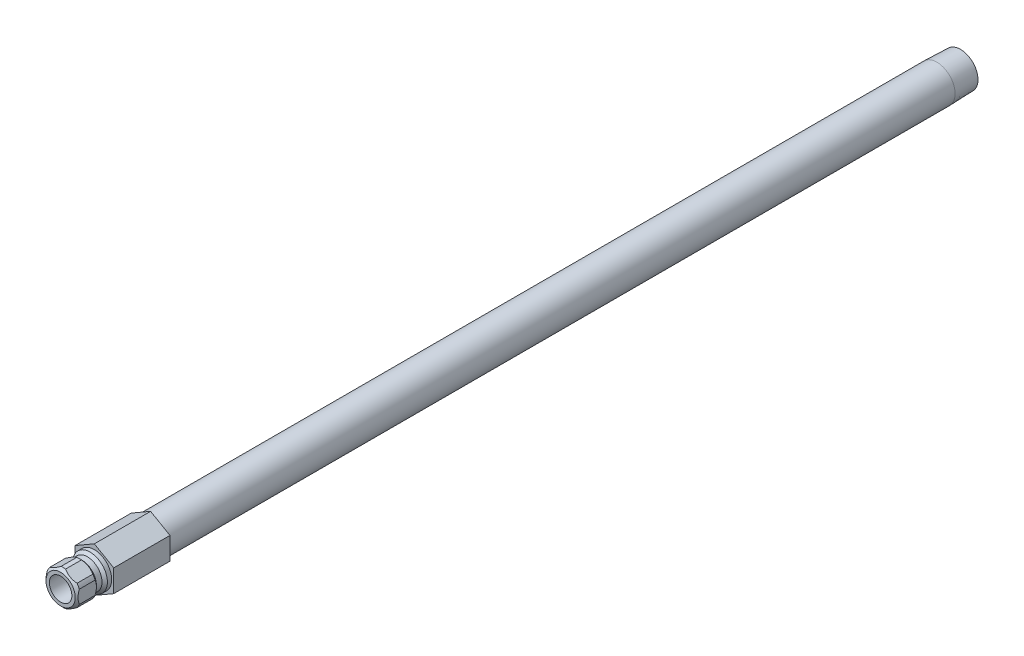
ISO-10303-21;
HEADER;
FILE_DESCRIPTION(('STEP AP214'),'2;1');
FILE_NAME('part.step','',(''),(''),'','','');
FILE_SCHEMA(('AUTOMOTIVE_DESIGN { 1 0 10303 214 1 1 1 1 }'));
ENDSEC;
DATA;
#1=APPLICATION_CONTEXT('core data for automotive mechanical design processes');
#2=APPLICATION_PROTOCOL_DEFINITION('international standard','automotive_design',2000,#1);
#3=PRODUCT_CONTEXT('',#1,'mechanical');
#4=PRODUCT('Part','Part','',(#3));
#5=PRODUCT_RELATED_PRODUCT_CATEGORY('part','',(#4));
#6=PRODUCT_DEFINITION_FORMATION('','',#4);
#7=PRODUCT_DEFINITION_CONTEXT('part definition',#1,'design');
#8=PRODUCT_DEFINITION('design','',#6,#7);
#9=PRODUCT_DEFINITION_SHAPE('','',#8);
#10=(LENGTH_UNIT() NAMED_UNIT(*) SI_UNIT(.MILLI.,.METRE.));
#11=(NAMED_UNIT(*) PLANE_ANGLE_UNIT() SI_UNIT($,.RADIAN.));
#12=(NAMED_UNIT(*) SI_UNIT($,.STERADIAN.) SOLID_ANGLE_UNIT());
#13=UNCERTAINTY_MEASURE_WITH_UNIT(LENGTH_MEASURE(1.E-05),#10,'distance_accuracy_value','');
#14=(GEOMETRIC_REPRESENTATION_CONTEXT(3) GLOBAL_UNCERTAINTY_ASSIGNED_CONTEXT((#13)) GLOBAL_UNIT_ASSIGNED_CONTEXT((#10,
#11,#12)) REPRESENTATION_CONTEXT('',''));
#15=CARTESIAN_POINT('',(0.,0.,0.));
#16=DIRECTION('',(0.,0.,1.));
#17=DIRECTION('',(1.,0.,0.));
#18=AXIS2_PLACEMENT_3D('',#15,#16,#17);
#19=CARTESIAN_POINT('',(0.,0.,0.));
#20=DIRECTION('',(0.,0.,-1.));
#21=DIRECTION('',(0.,1.,0.));
#22=AXIS2_PLACEMENT_3D('',#19,#20,#21);
#23=CYLINDRICAL_SURFACE('',#22,4.8895);
#24=DIRECTION('',(0.,0.,-1.));
#25=VECTOR('',#24,1.);
#26=CARTESIAN_POINT('',(-4.5212,-1.86170910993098,0.));
#27=LINE('',#26,#25);
#28=CARTESIAN_POINT('',(-4.5212,-1.86170910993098,4.318));
#29=VERTEX_POINT('',#28);
#30=CARTESIAN_POINT('',(-4.5212,-1.86170910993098,8.763));
#31=VERTEX_POINT('',#30);
#32=EDGE_CURVE('E61',#29,#31,#27,.F.);
#33=ORIENTED_EDGE('',*,*,#32,.F.);
#34=CARTESIAN_POINT('',(0.,0.,4.318));
#35=DIRECTION('',(0.,0.,-1.));
#36=DIRECTION('',(0.,1.,0.));
#37=AXIS2_PLACEMENT_3D('',#34,#35,#36);
#38=CIRCLE('',#37,4.8895);
#39=CARTESIAN_POINT('',(-3.87288738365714,-2.98461950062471,4.318));
#40=VERTEX_POINT('',#39);
#41=EDGE_CURVE('E650',#40,#29,#38,.T.);
#42=ORIENTED_EDGE('',*,*,#41,.F.);
#43=DIRECTION('',(0.,0.,-1.));
#44=VECTOR('',#43,1.);
#45=CARTESIAN_POINT('',(-3.87288738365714,-2.98461950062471,0.));
#46=LINE('',#45,#44);
#47=CARTESIAN_POINT('',(-3.87288738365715,-2.98461950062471,8.763));
#48=VERTEX_POINT('',#47);
#49=EDGE_CURVE('E218',#48,#40,#46,.T.);
#50=ORIENTED_EDGE('',*,*,#49,.F.);
#51=CARTESIAN_POINT('',(0.,0.,8.763));
#52=DIRECTION('',(0.,0.,-1.));
#53=DIRECTION('',(0.,1.,0.));
#54=AXIS2_PLACEMENT_3D('',#51,#52,#53);
#55=CIRCLE('',#54,4.8895);
#56=EDGE_CURVE('E189',#48,#31,#55,.T.);
#57=ORIENTED_EDGE('',*,*,#56,.T.);
#58=EDGE_LOOP('',(#33,#42,#50,#57));
#59=FACE_BOUND('',#58,.T.);
#60=ADVANCED_FACE('F34',(#59),#23,.T.);
#61=DIRECTION('',(0.,0.,-1.));
#62=VECTOR('',#61,1.);
#63=CARTESIAN_POINT('',(-0.648312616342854,-4.84632861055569,0.));
#64=LINE('',#63,#62);
#65=CARTESIAN_POINT('',(-0.648312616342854,-4.84632861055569,4.318));
#66=VERTEX_POINT('',#65);
#67=CARTESIAN_POINT('',(-0.648312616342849,-4.84632861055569,8.763));
#68=VERTEX_POINT('',#67);
#69=EDGE_CURVE('E232',#66,#68,#64,.F.);
#70=ORIENTED_EDGE('',*,*,#69,.F.);
#71=CARTESIAN_POINT('',(0.648312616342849,-4.84632861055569,4.318));
#72=VERTEX_POINT('',#71);
#73=EDGE_CURVE('E388',#72,#66,#38,.T.);
#74=ORIENTED_EDGE('',*,*,#73,.F.);
#75=DIRECTION('',(0.,0.,-1.));
#76=VECTOR('',#75,1.);
#77=CARTESIAN_POINT('',(0.648312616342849,-4.84632861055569,0.));
#78=LINE('',#77,#76);
#79=CARTESIAN_POINT('',(0.648312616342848,-4.84632861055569,8.763));
#80=VERTEX_POINT('',#79);
#81=EDGE_CURVE('E654',#80,#72,#78,.T.);
#82=ORIENTED_EDGE('',*,*,#81,.F.);
#83=EDGE_CURVE('E202',#80,#68,#55,.T.);
#84=ORIENTED_EDGE('',*,*,#83,.T.);
#85=EDGE_LOOP('',(#70,#74,#82,#84));
#86=FACE_BOUND('',#85,.T.);
#87=ADVANCED_FACE('F351',(#86),#23,.T.);
#88=DIRECTION('',(0.,0.,-1.));
#89=VECTOR('',#88,1.);
#90=CARTESIAN_POINT('',(3.87288738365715,-2.98461950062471,0.));
#91=LINE('',#90,#89);
#92=CARTESIAN_POINT('',(3.87288738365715,-2.98461950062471,4.318));
#93=VERTEX_POINT('',#92);
#94=CARTESIAN_POINT('',(3.87288738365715,-2.98461950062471,8.763));
#95=VERTEX_POINT('',#94);
#96=EDGE_CURVE('E294',#93,#95,#91,.F.);
#97=ORIENTED_EDGE('',*,*,#96,.F.);
#98=CARTESIAN_POINT('',(4.5212,-1.86170910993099,4.318));
#99=VERTEX_POINT('',#98);
#100=EDGE_CURVE('E384',#99,#93,#38,.T.);
#101=ORIENTED_EDGE('',*,*,#100,.F.);
#102=DIRECTION('',(0.,0.,-1.));
#103=VECTOR('',#102,1.);
#104=CARTESIAN_POINT('',(4.5212,-1.86170910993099,0.));
#105=LINE('',#104,#103);
#106=CARTESIAN_POINT('',(4.5212,-1.86170910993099,8.763));
#107=VERTEX_POINT('',#106);
#108=EDGE_CURVE('E377',#107,#99,#105,.T.);
#109=ORIENTED_EDGE('',*,*,#108,.F.);
#110=EDGE_CURVE('E195',#107,#95,#55,.T.);
#111=ORIENTED_EDGE('',*,*,#110,.T.);
#112=EDGE_LOOP('',(#97,#101,#109,#111));
#113=FACE_BOUND('',#112,.T.);
#114=ADVANCED_FACE('F355',(#113),#23,.T.);
#115=DIRECTION('',(0.,0.,-1.));
#116=VECTOR('',#115,1.);
#117=CARTESIAN_POINT('',(4.5212,1.86170910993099,0.));
#118=LINE('',#117,#116);
#119=CARTESIAN_POINT('',(4.5212,1.86170910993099,4.318));
#120=VERTEX_POINT('',#119);
#121=CARTESIAN_POINT('',(4.5212,1.86170910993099,8.763));
#122=VERTEX_POINT('',#121);
#123=EDGE_CURVE('E373',#120,#122,#118,.F.);
#124=ORIENTED_EDGE('',*,*,#123,.F.);
#125=CARTESIAN_POINT('',(3.87288738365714,2.98461950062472,4.318));
#126=VERTEX_POINT('',#125);
#127=EDGE_CURVE('E200',#126,#120,#38,.T.);
#128=ORIENTED_EDGE('',*,*,#127,.F.);
#129=DIRECTION('',(0.,0.,-1.));
#130=VECTOR('',#129,1.);
#131=CARTESIAN_POINT('',(3.87288738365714,2.98461950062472,0.));
#132=LINE('',#131,#130);
#133=CARTESIAN_POINT('',(3.87288738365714,2.98461950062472,8.763));
#134=VERTEX_POINT('',#133);
#135=EDGE_CURVE('E651',#134,#126,#132,.T.);
#136=ORIENTED_EDGE('',*,*,#135,.F.);
#137=EDGE_CURVE('E188',#134,#122,#55,.T.);
#138=ORIENTED_EDGE('',*,*,#137,.T.);
#139=EDGE_LOOP('',(#124,#128,#136,#138));
#140=FACE_BOUND('',#139,.T.);
#141=ADVANCED_FACE('F361',(#140),#23,.T.);
#142=DIRECTION('',(0.,0.,-1.));
#143=VECTOR('',#142,1.);
#144=CARTESIAN_POINT('',(0.648312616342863,4.84632861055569,0.));
#145=LINE('',#144,#143);
#146=CARTESIAN_POINT('',(0.648312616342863,4.84632861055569,4.318));
#147=VERTEX_POINT('',#146);
#148=CARTESIAN_POINT('',(0.648312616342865,4.84632861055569,8.763));
#149=VERTEX_POINT('',#148);
#150=EDGE_CURVE('E652',#147,#149,#145,.F.);
#151=ORIENTED_EDGE('',*,*,#150,.F.);
#152=CARTESIAN_POINT('',(-0.648312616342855,4.84632861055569,4.318));
#153=VERTEX_POINT('',#152);
#154=EDGE_CURVE('E179',#153,#147,#38,.T.);
#155=ORIENTED_EDGE('',*,*,#154,.F.);
#156=DIRECTION('',(0.,0.,-1.));
#157=VECTOR('',#156,1.);
#158=CARTESIAN_POINT('',(-0.648312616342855,4.84632861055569,0.));
#159=LINE('',#158,#157);
#160=CARTESIAN_POINT('',(-0.648312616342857,4.84632861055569,8.763));
#161=VERTEX_POINT('',#160);
#162=EDGE_CURVE('E163',#161,#153,#159,.T.);
#163=ORIENTED_EDGE('',*,*,#162,.F.);
#164=EDGE_CURVE('E177',#161,#149,#55,.T.);
#165=ORIENTED_EDGE('',*,*,#164,.T.);
#166=EDGE_LOOP('',(#151,#155,#163,#165));
#167=FACE_BOUND('',#166,.T.);
#168=ADVANCED_FACE('F176',(#167),#23,.T.);
#169=CARTESIAN_POINT('',(0.,4.8895,0.));
#170=DIRECTION('',(0.,0.,1.));
#171=DIRECTION('',(0.,-1.,0.));
#172=AXIS2_PLACEMENT_3D('',#169,#170,#171);
#173=PLANE('',#172);
#174=CARTESIAN_POINT('',(0.,0.,0.));
#175=DIRECTION('',(0.,0.,-1.));
#176=DIRECTION('',(0.,1.,0.));
#177=AXIS2_PLACEMENT_3D('',#174,#175,#176);
#178=CIRCLE('',#177,4.8895);
#179=CARTESIAN_POINT('',(0.,4.8895,0.));
#180=VERTEX_POINT('',#179);
#181=EDGE_CURVE('E395',#180,#180,#178,.T.);
#182=ORIENTED_EDGE('',*,*,#181,.T.);
#183=EDGE_LOOP('',(#182));
#184=FACE_BOUND('',#183,.T.);
#185=DIRECTION('',(-0.866025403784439,-0.5,0.));
#186=VECTOR('',#185,1.);
#187=CARTESIAN_POINT('',(0.,6.3058196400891,0.));
#188=LINE('',#187,#186);
#189=CARTESIAN_POINT('',(0.,6.3058196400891,0.));
#190=VERTEX_POINT('',#189);
#191=CARTESIAN_POINT('',(-5.461,3.15290982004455,0.));
#192=VERTEX_POINT('',#191);
#193=EDGE_CURVE('E445',#190,#192,#188,.T.);
#194=ORIENTED_EDGE('',*,*,#193,.T.);
#195=DIRECTION('',(0.,-1.,0.));
#196=VECTOR('',#195,1.);
#197=CARTESIAN_POINT('',(-5.461,3.15290982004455,0.));
#198=LINE('',#197,#196);
#199=CARTESIAN_POINT('',(-5.461,-3.15290982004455,0.));
#200=VERTEX_POINT('',#199);
#201=EDGE_CURVE('E448',#192,#200,#198,.T.);
#202=ORIENTED_EDGE('',*,*,#201,.T.);
#203=DIRECTION('',(0.866025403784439,-0.5,0.));
#204=VECTOR('',#203,1.);
#205=CARTESIAN_POINT('',(-5.461,-3.15290982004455,0.));
#206=LINE('',#205,#204);
#207=CARTESIAN_POINT('',(0.,-6.30581964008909,0.));
#208=VERTEX_POINT('',#207);
#209=EDGE_CURVE('E451',#200,#208,#206,.T.);
#210=ORIENTED_EDGE('',*,*,#209,.T.);
#211=DIRECTION('',(0.866025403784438,0.5,0.));
#212=VECTOR('',#211,1.);
#213=CARTESIAN_POINT('',(0.,-6.30581964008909,0.));
#214=LINE('',#213,#212);
#215=CARTESIAN_POINT('',(5.461,-3.15290982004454,0.));
#216=VERTEX_POINT('',#215);
#217=EDGE_CURVE('E454',#208,#216,#214,.T.);
#218=ORIENTED_EDGE('',*,*,#217,.T.);
#219=DIRECTION('',(0.,1.,0.));
#220=VECTOR('',#219,1.);
#221=CARTESIAN_POINT('',(5.461,-3.15290982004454,0.));
#222=LINE('',#221,#220);
#223=CARTESIAN_POINT('',(5.461,3.15290982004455,0.));
#224=VERTEX_POINT('',#223);
#225=EDGE_CURVE('E456',#216,#224,#222,.T.);
#226=ORIENTED_EDGE('',*,*,#225,.T.);
#227=DIRECTION('',(-0.866025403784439,0.5,0.));
#228=VECTOR('',#227,1.);
#229=CARTESIAN_POINT('',(5.461,3.15290982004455,0.));
#230=LINE('',#229,#228);
#231=EDGE_CURVE('E424',#224,#190,#230,.T.);
#232=ORIENTED_EDGE('',*,*,#231,.T.);
#233=EDGE_LOOP('',(#194,#202,#210,#218,#226,#232));
#234=FACE_BOUND('',#233,.T.);
#235=ADVANCED_FACE('F360',(#184,#234),#173,.T.);
#236=CARTESIAN_POINT('',(0.,0.,0.));
#237=DIRECTION('',(0.,0.,-1.));
#238=DIRECTION('',(0.,1.,0.));
#239=AXIS2_PLACEMENT_3D('',#236,#237,#238);
#240=CYLINDRICAL_SURFACE('',#239,4.8895);
#241=CARTESIAN_POINT('',(0.,0.,1.2065));
#242=DIRECTION('',(0.,0.,-1.));
#243=DIRECTION('',(0.,1.,0.));
#244=AXIS2_PLACEMENT_3D('',#241,#242,#243);
#245=CIRCLE('',#244,4.8895);
#246=CARTESIAN_POINT('',(0.,4.8895,1.2065));
#247=VERTEX_POINT('',#246);
#248=EDGE_CURVE('E392',#247,#247,#245,.T.);
#249=ORIENTED_EDGE('',*,*,#248,.T.);
#250=EDGE_LOOP('',(#249));
#251=FACE_BOUND('',#250,.T.);
#252=ORIENTED_EDGE('',*,*,#181,.F.);
#253=EDGE_LOOP('',(#252));
#254=FACE_BOUND('',#253,.T.);
#255=ADVANCED_FACE('F366',(#251,#254),#240,.T.);
#256=CARTESIAN_POINT('',(0.,0.,1.2065));
#257=DIRECTION('',(0.,0.,-1.));
#258=DIRECTION('',(0.,1.,0.));
#259=AXIS2_PLACEMENT_3D('',#256,#257,#258);
#260=CONICAL_SURFACE('',#259,4.8895,0.785398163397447);
#261=CARTESIAN_POINT('',(0.,0.,1.9685));
#262=DIRECTION('',(0.,0.,-1.));
#263=DIRECTION('',(0.,1.,0.));
#264=AXIS2_PLACEMENT_3D('',#261,#262,#263);
#265=CIRCLE('',#264,4.1275);
#266=CARTESIAN_POINT('',(0.,4.1275,1.9685));
#267=VERTEX_POINT('',#266);
#268=EDGE_CURVE('E386',#267,#267,#265,.T.);
#269=ORIENTED_EDGE('',*,*,#268,.T.);
#270=EDGE_LOOP('',(#269));
#271=FACE_BOUND('',#270,.T.);
#272=ORIENTED_EDGE('',*,*,#248,.F.);
#273=EDGE_LOOP('',(#272));
#274=FACE_BOUND('',#273,.T.);
#275=ADVANCED_FACE('F704',(#271,#274),#260,.T.);
#276=CARTESIAN_POINT('',(0.,0.,0.));
#277=DIRECTION('',(0.,0.,-1.));
#278=DIRECTION('',(0.,1.,0.));
#279=AXIS2_PLACEMENT_3D('',#276,#277,#278);
#280=CYLINDRICAL_SURFACE('',#279,4.1275);
#281=CARTESIAN_POINT('',(0.,0.,3.556));
#282=DIRECTION('',(0.,0.,-1.));
#283=DIRECTION('',(0.,1.,0.));
#284=AXIS2_PLACEMENT_3D('',#281,#282,#283);
#285=CIRCLE('',#284,4.1275);
#286=CARTESIAN_POINT('',(0.,4.1275,3.556));
#287=VERTEX_POINT('',#286);
#288=EDGE_CURVE('E383',#287,#287,#285,.T.);
#289=ORIENTED_EDGE('',*,*,#288,.T.);
#290=EDGE_LOOP('',(#289));
#291=FACE_BOUND('',#290,.T.);
#292=ORIENTED_EDGE('',*,*,#268,.F.);
#293=EDGE_LOOP('',(#292));
#294=FACE_BOUND('',#293,.T.);
#295=ADVANCED_FACE('F254',(#291,#294),#280,.T.);
#296=CARTESIAN_POINT('',(0.,0.,3.556));
#297=DIRECTION('',(0.,0.,1.));
#298=DIRECTION('',(0.,-1.,0.));
#299=AXIS2_PLACEMENT_3D('',#296,#297,#298);
#300=CONICAL_SURFACE('',#299,4.1275,0.785398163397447);
#301=CARTESIAN_POINT('',(-4.5212,-5.15925306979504,6.2884665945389));
#302=CARTESIAN_POINT('',(-4.5212,-5.03341781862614,6.19384981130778));
#303=CARTESIAN_POINT('',(-4.5212,-4.90687282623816,6.10016148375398));
#304=CARTESIAN_POINT('',(-4.5212,-4.65208542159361,5.91505573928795));
#305=CARTESIAN_POINT('',(-4.5212,-4.52384258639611,5.82363890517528));
#306=CARTESIAN_POINT('',(-4.5212,-4.26444371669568,5.64284060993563));
#307=CARTESIAN_POINT('',(-4.5212,-4.13327280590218,5.55348041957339));
#308=CARTESIAN_POINT('',(-4.5212,-3.86869655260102,5.37814219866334));
#309=CARTESIAN_POINT('',(-4.5212,-3.735291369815,5.29216392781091));
#310=CARTESIAN_POINT('',(-4.5212,-3.45835736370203,5.1196421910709));
#311=CARTESIAN_POINT('',(-4.5212,-3.31467977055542,5.03333631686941));
#312=CARTESIAN_POINT('',(-4.5212,-3.02397608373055,4.86646929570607));
#313=CARTESIAN_POINT('',(-4.5212,-2.87694947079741,4.78590904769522));
#314=CARTESIAN_POINT('',(-4.5212,-2.57957206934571,4.6322757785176));
#315=CARTESIAN_POINT('',(-4.5212,-2.42923274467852,4.55918074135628));
#316=CARTESIAN_POINT('',(-4.5212,-2.12448469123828,4.42211381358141));
#317=CARTESIAN_POINT('',(-4.5212,-1.97007782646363,4.35813782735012));
#318=CARTESIAN_POINT('',(-4.5212,-1.66898205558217,4.24604782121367));
#319=CARTESIAN_POINT('',(-4.5212,-1.52260919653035,4.19709368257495));
#320=CARTESIAN_POINT('',(-4.5212,-1.22638031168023,4.11093488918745));
#321=CARTESIAN_POINT('',(-4.5212,-1.07652404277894,4.07373105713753));
#322=CARTESIAN_POINT('',(-4.5212,-0.776693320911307,4.01362130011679));
#323=CARTESIAN_POINT('',(-4.5212,-0.626768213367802,3.99047322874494));
#324=CARTESIAN_POINT('',(-4.5212,-0.325366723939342,3.95891692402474));
#325=CARTESIAN_POINT('',(-4.5212,-0.173890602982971,3.95050625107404));
#326=CARTESIAN_POINT('',(-4.5212,0.123852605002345,3.94903068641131));
#327=CARTESIAN_POINT('',(-4.5212,0.270117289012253,3.95544130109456));
#328=CARTESIAN_POINT('',(-4.5212,0.561370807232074,3.98210770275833));
#329=CARTESIAN_POINT('',(-4.5212,0.706359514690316,4.0023648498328));
#330=CARTESIAN_POINT('',(-4.5212,0.996462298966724,4.05597163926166));
#331=CARTESIAN_POINT('',(-4.5212,1.14153485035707,4.08954247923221));
#332=CARTESIAN_POINT('',(-4.5212,1.42852462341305,4.16800024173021));
#333=CARTESIAN_POINT('',(-4.5212,1.5704421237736,4.21288616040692));
#334=CARTESIAN_POINT('',(-4.5212,1.86505501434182,4.3171412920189));
#335=CARTESIAN_POINT('',(-4.5212,2.01739126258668,4.37751543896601));
#336=CARTESIAN_POINT('',(-4.5212,2.31809735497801,4.5075182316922));
#337=CARTESIAN_POINT('',(-4.5212,2.46646529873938,4.57715121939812));
#338=CARTESIAN_POINT('',(-4.5212,2.75996557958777,4.72401353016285));
#339=CARTESIAN_POINT('',(-4.5212,2.90508583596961,4.80126680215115));
#340=CARTESIAN_POINT('',(-4.5212,3.19198335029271,4.96166050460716));
#341=CARTESIAN_POINT('',(-4.5212,3.33376113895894,5.04479999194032));
#342=CARTESIAN_POINT('',(-4.5212,3.60742153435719,5.21154136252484));
#343=CARTESIAN_POINT('',(-4.5212,3.73944496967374,5.29491333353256));
#344=CARTESIAN_POINT('',(-4.5212,4.00122581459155,5.4651527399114));
#345=CARTESIAN_POINT('',(-4.5212,4.13098305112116,5.55202044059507));
#346=CARTESIAN_POINT('',(-4.5212,4.387473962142,5.72790624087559));
#347=CARTESIAN_POINT('',(-4.5212,4.51422365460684,5.81690106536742));
#348=CARTESIAN_POINT('',(-4.5212,4.76599253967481,5.99723636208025));
#349=CARTESIAN_POINT('',(-4.5212,4.8910121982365,6.08857618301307));
#350=CARTESIAN_POINT('',(-4.5212,5.01530771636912,6.18087446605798));
#351=B_SPLINE_CURVE_WITH_KNOTS('',3,(#301,#302,#303,#304,#305,#306,#307,#308,#309,#310,#311,
#312,#313,#314,#315,#316,#317,#318,#319,#320,#321,#322,#323,#324,#325,#326,#327,#328,#329,#330,
#331,#332,#333,#334,#335,#336,#337,#338,#339,#340,#341,#342,#343,#344,#345,#346,#347,#348,#349,
#350),.UNSPECIFIED.,.F.,.F.,(4,2,2,2,2,2,2,2,2,2,2,2,2,2,2,2,2,2,2,2,2,2,2,2,4),(0.,
0.472324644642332,0.944769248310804,1.42087610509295,1.89694907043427,2.39966187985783,
2.90245317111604,3.40371602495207,3.90475303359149,4.3673713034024,4.83002195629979,
5.28445770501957,5.73881822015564,6.1773471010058,6.615919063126,7.06210522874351,
7.50825182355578,7.9994594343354,8.49089821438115,8.98393391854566,9.47689080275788,
9.94525924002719,10.4136632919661,10.8782525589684,11.3427141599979),.UNSPECIFIED.);
#352=CARTESIAN_POINT('',(-4.5212,1.86170910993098,4.318));
#353=VERTEX_POINT('',#352);
#354=EDGE_CURVE('E230',#353,#29,#351,.F.);
#355=ORIENTED_EDGE('',*,*,#354,.F.);
#356=CARTESIAN_POINT('',(-3.87288738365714,2.98461950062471,4.318));
#357=VERTEX_POINT('',#356);
#358=EDGE_CURVE('E199',#353,#357,#38,.T.);
#359=ORIENTED_EDGE('',*,*,#358,.T.);
#360=CARTESIAN_POINT('',(-0.647857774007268,4.84659121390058,4.3182));
#361=CARTESIAN_POINT('',(-0.775261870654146,4.77303442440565,4.26213711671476));
#362=CARTESIAN_POINT('',(-0.904457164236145,4.69844348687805,4.21102627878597));
#363=CARTESIAN_POINT('',(-1.16629518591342,4.5472712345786,4.12074318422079));
#364=CARTESIAN_POINT('',(-1.29894624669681,4.47068510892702,4.08160338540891));
#365=CARTESIAN_POINT('',(-1.56203676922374,4.31878972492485,4.01877592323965));
#366=CARTESIAN_POINT('',(-1.69238331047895,4.24353411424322,3.99458163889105));
#367=CARTESIAN_POINT('',(-1.95434729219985,4.09228913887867,3.96102228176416));
#368=CARTESIAN_POINT('',(-2.0859628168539,4.01630088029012,3.95163757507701));
#369=CARTESIAN_POINT('',(-2.35623055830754,3.86026172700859,3.9482192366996));
#370=CARTESIAN_POINT('',(-2.49489129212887,3.78020591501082,3.95501290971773));
#371=CARTESIAN_POINT('',(-2.7710334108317,3.62077518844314,3.98518499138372));
#372=CARTESIAN_POINT('',(-2.90851272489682,3.54140146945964,4.00858815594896));
#373=CARTESIAN_POINT('',(-3.18622016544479,3.38106700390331,4.07155129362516));
#374=CARTESIAN_POINT('',(-3.32634361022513,3.3001666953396,4.11171074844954));
#375=CARTESIAN_POINT('',(-3.60275664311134,3.14057955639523,4.20550294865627));
#376=CARTESIAN_POINT('',(-3.73905611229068,3.06188702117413,4.2590965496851));
#377=CARTESIAN_POINT('',(-3.87334222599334,2.98435689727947,4.31820000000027));
#378=B_SPLINE_CURVE_WITH_KNOTS('',3,(#360,#361,#362,#363,#364,#365,#366,#367,#368,#369,#370,
#371,#372,#373,#374,#375,#376,#377),.UNSPECIFIED.,.F.,.F.,(4,2,2,2,2,2,2,2,4),(0.,
0.472469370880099,0.946208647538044,1.40285320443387,1.85889185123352,2.33874707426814,
2.81931901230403,3.31879975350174,3.81684169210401),.UNSPECIFIED.);
#379=EDGE_CURVE('E260',#153,#357,#378,.T.);
#380=ORIENTED_EDGE('',*,*,#379,.F.);
#381=ORIENTED_EDGE('',*,*,#154,.T.);
#382=CARTESIAN_POINT('',(3.87334222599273,2.98435689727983,4.3182));
#383=CARTESIAN_POINT('',(3.74593812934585,3.05791368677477,4.26213711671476));
#384=CARTESIAN_POINT('',(3.61674283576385,3.13250462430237,4.21102627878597));
#385=CARTESIAN_POINT('',(3.35490481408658,3.28367687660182,4.12074318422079));
#386=CARTESIAN_POINT('',(3.22225375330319,3.3602630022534,4.08160338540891));
#387=CARTESIAN_POINT('',(2.95916323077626,3.51215838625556,4.01877592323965));
#388=CARTESIAN_POINT('',(2.82881668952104,3.5874139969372,3.99458163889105));
#389=CARTESIAN_POINT('',(2.56685270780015,3.73865897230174,3.96102228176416));
#390=CARTESIAN_POINT('',(2.4352371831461,3.81464723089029,3.95163757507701));
#391=CARTESIAN_POINT('',(2.16496944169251,3.97068638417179,3.94821923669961));
#392=CARTESIAN_POINT('',(2.02630870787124,4.05074219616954,3.95501290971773));
#393=CARTESIAN_POINT('',(1.75016658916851,4.21017292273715,3.98518499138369));
#394=CARTESIAN_POINT('',(1.61268727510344,4.28954664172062,4.00858815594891));
#395=CARTESIAN_POINT('',(1.33497983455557,4.44988110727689,4.07155129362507));
#396=CARTESIAN_POINT('',(1.19485638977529,4.53078141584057,4.11171074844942));
#397=CARTESIAN_POINT('',(0.918443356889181,4.69036855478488,4.20550294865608));
#398=CARTESIAN_POINT('',(0.782143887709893,4.76906109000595,4.25909654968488));
#399=CARTESIAN_POINT('',(0.647857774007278,4.84659121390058,4.3182));
#400=B_SPLINE_CURVE_WITH_KNOTS('',3,(#382,#383,#384,#385,#386,#387,#388,#389,#390,#391,#392,
#393,#394,#395,#396,#397,#398,#399),.UNSPECIFIED.,.F.,.F.,(4,2,2,2,2,2,2,2,4),(0.,
0.472469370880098,0.946208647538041,1.40285320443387,1.85889185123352,2.33874707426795,
2.81931901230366,3.31879975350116,3.81684169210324),.UNSPECIFIED.);
#401=EDGE_CURVE('E270',#126,#147,#400,.T.);
#402=ORIENTED_EDGE('',*,*,#401,.F.);
#403=ORIENTED_EDGE('',*,*,#127,.T.);
#404=CARTESIAN_POINT('',(4.5212,-5.15925306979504,6.2884665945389));
#405=CARTESIAN_POINT('',(4.5212,-5.03341781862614,6.19384981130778));
#406=CARTESIAN_POINT('',(4.5212,-4.90687282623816,6.10016148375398));
#407=CARTESIAN_POINT('',(4.5212,-4.65208542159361,5.91505573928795));
#408=CARTESIAN_POINT('',(4.5212,-4.52384258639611,5.82363890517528));
#409=CARTESIAN_POINT('',(4.5212,-4.26444371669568,5.64284060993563));
#410=CARTESIAN_POINT('',(4.5212,-4.13327280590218,5.55348041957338));
#411=CARTESIAN_POINT('',(4.5212,-3.86869655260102,5.37814219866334));
#412=CARTESIAN_POINT('',(4.5212,-3.735291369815,5.2921639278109));
#413=CARTESIAN_POINT('',(4.5212,-3.45835736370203,5.1196421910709));
#414=CARTESIAN_POINT('',(4.5212,-3.31467977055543,5.03333631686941));
#415=CARTESIAN_POINT('',(4.5212,-3.02397608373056,4.86646929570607));
#416=CARTESIAN_POINT('',(4.5212,-2.87694947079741,4.78590904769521));
#417=CARTESIAN_POINT('',(4.5212,-2.57957206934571,4.63227577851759));
#418=CARTESIAN_POINT('',(4.5212,-2.42923274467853,4.55918074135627));
#419=CARTESIAN_POINT('',(4.5212,-2.12448469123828,4.4221138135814));
#420=CARTESIAN_POINT('',(4.5212,-1.97007782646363,4.35813782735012));
#421=CARTESIAN_POINT('',(4.5212,-1.66898205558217,4.24604782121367));
#422=CARTESIAN_POINT('',(4.5212,-1.52260919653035,4.19709368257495));
#423=CARTESIAN_POINT('',(4.5212,-1.22638031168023,4.11093488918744));
#424=CARTESIAN_POINT('',(4.5212,-1.07652404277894,4.07373105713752));
#425=CARTESIAN_POINT('',(4.5212,-0.776693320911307,4.01362130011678));
#426=CARTESIAN_POINT('',(4.5212,-0.626768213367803,3.99047322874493));
#427=CARTESIAN_POINT('',(4.5212,-0.325366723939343,3.95891692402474));
#428=CARTESIAN_POINT('',(4.5212,-0.173890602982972,3.95050625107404));
#429=CARTESIAN_POINT('',(4.5212,0.123852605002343,3.94903068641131));
#430=CARTESIAN_POINT('',(4.5212,0.27011728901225,3.95544130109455));
#431=CARTESIAN_POINT('',(4.5212,0.561370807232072,3.98210770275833));
#432=CARTESIAN_POINT('',(4.5212,0.706359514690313,4.0023648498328));
#433=CARTESIAN_POINT('',(4.5212,0.99646229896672,4.05597163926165));
#434=CARTESIAN_POINT('',(4.5212,1.14153485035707,4.08954247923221));
#435=CARTESIAN_POINT('',(4.5212,1.42852462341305,4.16800024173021));
#436=CARTESIAN_POINT('',(4.5212,1.5704421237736,4.21288616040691));
#437=CARTESIAN_POINT('',(4.5212,1.86505501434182,4.3171412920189));
#438=CARTESIAN_POINT('',(4.5212,2.01739126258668,4.377515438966));
#439=CARTESIAN_POINT('',(4.5212,2.318097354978,4.50751823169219));
#440=CARTESIAN_POINT('',(4.5212,2.46646529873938,4.57715121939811));
#441=CARTESIAN_POINT('',(4.5212,2.75996557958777,4.72401353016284));
#442=CARTESIAN_POINT('',(4.5212,2.9050858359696,4.80126680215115));
#443=CARTESIAN_POINT('',(4.5212,3.1919833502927,4.96166050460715));
#444=CARTESIAN_POINT('',(4.5212,3.33376113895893,5.04479999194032));
#445=CARTESIAN_POINT('',(4.5212,3.60742153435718,5.21154136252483));
#446=CARTESIAN_POINT('',(4.5212,3.73944496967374,5.29491333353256));
#447=CARTESIAN_POINT('',(4.5212,4.00122581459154,5.46515273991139));
#448=CARTESIAN_POINT('',(4.5212,4.13098305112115,5.55202044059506));
#449=CARTESIAN_POINT('',(4.5212,4.38747396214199,5.72790624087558));
#450=CARTESIAN_POINT('',(4.5212,4.51422365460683,5.81690106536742));
#451=CARTESIAN_POINT('',(4.5212,4.76599253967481,5.99723636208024));
#452=CARTESIAN_POINT('',(4.5212,4.89101219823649,6.08857618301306));
#453=CARTESIAN_POINT('',(4.5212,5.01530771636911,6.18087446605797));
#454=B_SPLINE_CURVE_WITH_KNOTS('',3,(#404,#405,#406,#407,#408,#409,#410,#411,#412,#413,#414,
#415,#416,#417,#418,#419,#420,#421,#422,#423,#424,#425,#426,#427,#428,#429,#430,#431,#432,#433,
#434,#435,#436,#437,#438,#439,#440,#441,#442,#443,#444,#445,#446,#447,#448,#449,#450,#451,#452,
#453),.UNSPECIFIED.,.F.,.F.,(4,2,2,2,2,2,2,2,2,2,2,2,2,2,2,2,2,2,2,2,2,2,2,2,4),(0.,
0.472324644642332,0.944769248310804,1.42087610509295,1.89694907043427,2.39966187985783,
2.90245317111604,3.40371602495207,3.90475303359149,4.3673713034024,4.83002195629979,
5.28445770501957,5.73881822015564,6.1773471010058,6.615919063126,7.06210522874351,
7.50825182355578,7.9994594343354,8.49089821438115,8.98393391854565,9.47689080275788,
9.94525924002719,10.4136632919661,10.8782525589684,11.3427141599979),.UNSPECIFIED.);
#455=EDGE_CURVE('E279',#99,#120,#454,.T.);
#456=ORIENTED_EDGE('',*,*,#455,.F.);
#457=ORIENTED_EDGE('',*,*,#100,.T.);
#458=CARTESIAN_POINT('',(0.647857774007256,-4.84659121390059,4.3182));
#459=CARTESIAN_POINT('',(0.775261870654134,-4.77303442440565,4.26213711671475));
#460=CARTESIAN_POINT('',(0.904457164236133,-4.69844348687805,4.21102627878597));
#461=CARTESIAN_POINT('',(1.16629518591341,-4.5472712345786,4.12074318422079));
#462=CARTESIAN_POINT('',(1.2989462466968,-4.47068510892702,4.08160338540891));
#463=CARTESIAN_POINT('',(1.56203676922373,-4.31878972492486,4.01877592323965));
#464=CARTESIAN_POINT('',(1.69238331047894,-4.24353411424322,3.99458163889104));
#465=CARTESIAN_POINT('',(1.95434729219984,-4.09228913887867,3.96102228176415));
#466=CARTESIAN_POINT('',(2.08596281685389,-4.01630088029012,3.951637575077));
#467=CARTESIAN_POINT('',(2.35623055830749,-3.86026172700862,3.9482192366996));
#468=CARTESIAN_POINT('',(2.49489129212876,-3.78020591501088,3.95501290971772));
#469=CARTESIAN_POINT('',(2.77103341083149,-3.62077518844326,3.98518499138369));
#470=CARTESIAN_POINT('',(2.90851272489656,-3.54140146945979,4.0085881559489));
#471=CARTESIAN_POINT('',(3.18622016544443,-3.38106700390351,4.07155129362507));
#472=CARTESIAN_POINT('',(3.32634361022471,-3.30016669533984,4.11171074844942));
#473=CARTESIAN_POINT('',(3.60275664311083,-3.14057955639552,4.20550294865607));
#474=CARTESIAN_POINT('',(3.73905611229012,-3.06188702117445,4.25909654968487));
#475=CARTESIAN_POINT('',(3.87334222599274,-2.98435689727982,4.3182));
#476=B_SPLINE_CURVE_WITH_KNOTS('',3,(#458,#459,#460,#461,#462,#463,#464,#465,#466,#467,#468,
#469,#470,#471,#472,#473,#474,#475),.UNSPECIFIED.,.F.,.F.,(4,2,2,2,2,2,2,2,4),(0.,
0.4724693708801,0.946208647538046,1.40285320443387,1.85889185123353,2.33874707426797,
2.81931901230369,3.3187997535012,3.81684169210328),.UNSPECIFIED.);
#477=EDGE_CURVE('E287',#72,#93,#476,.T.);
#478=ORIENTED_EDGE('',*,*,#477,.F.);
#479=ORIENTED_EDGE('',*,*,#73,.T.);
#480=CARTESIAN_POINT('',(-3.87334222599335,-2.98435689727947,4.31820000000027));
#481=CARTESIAN_POINT('',(-3.74593812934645,-3.05791368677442,4.262137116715));
#482=CARTESIAN_POINT('',(-3.61674283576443,-3.13250462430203,4.21102627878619));
#483=CARTESIAN_POINT('',(-3.35490481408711,-3.28367687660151,4.12074318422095));
#484=CARTESIAN_POINT('',(-3.2222537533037,-3.3602630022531,4.08160338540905));
#485=CARTESIAN_POINT('',(-2.95916323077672,-3.51215838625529,4.01877592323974));
#486=CARTESIAN_POINT('',(-2.82881668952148,-3.58741399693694,3.99458163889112));
#487=CARTESIAN_POINT('',(-2.56685270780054,-3.73865897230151,3.96102228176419));
#488=CARTESIAN_POINT('',(-2.43523718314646,-3.81464723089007,3.95163757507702));
#489=CARTESIAN_POINT('',(-2.16496944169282,-3.97068638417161,3.94821923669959));
#490=CARTESIAN_POINT('',(-2.02630870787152,-4.05074219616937,3.95501290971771));
#491=CARTESIAN_POINT('',(-1.75016658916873,-4.21017292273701,3.98518499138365));
#492=CARTESIAN_POINT('',(-1.61268727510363,-4.2895466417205,4.00858815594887));
#493=CARTESIAN_POINT('',(-1.33497983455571,-4.44988110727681,4.07155129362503));
#494=CARTESIAN_POINT('',(-1.1948563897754,-4.5307814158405,4.11171074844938));
#495=CARTESIAN_POINT('',(-0.918443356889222,-4.69036855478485,4.20550294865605));
#496=CARTESIAN_POINT('',(-0.782143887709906,-4.76906109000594,4.25909654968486));
#497=CARTESIAN_POINT('',(-0.647857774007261,-4.84659121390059,4.3182));
#498=B_SPLINE_CURVE_WITH_KNOTS('',3,(#480,#481,#482,#483,#484,#485,#486,#487,#488,#489,#490,
#491,#492,#493,#494,#495,#496,#497),.UNSPECIFIED.,.F.,.F.,(4,2,2,2,2,2,2,2,4),(0.,
0.472469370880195,0.946208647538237,1.40285320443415,1.85889185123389,2.33874707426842,
2.81931901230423,3.31879975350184,3.81684169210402),.UNSPECIFIED.);
#499=EDGE_CURVE('E228',#40,#66,#498,.T.);
#500=ORIENTED_EDGE('',*,*,#499,.F.);
#501=ORIENTED_EDGE('',*,*,#41,.T.);
#502=EDGE_LOOP('',(#355,#359,#380,#381,#402,#403,#456,#457,#478,#479,#500,#501));
#503=FACE_BOUND('',#502,.T.);
#504=ORIENTED_EDGE('',*,*,#288,.F.);
#505=EDGE_LOOP('',(#504));
#506=FACE_BOUND('',#505,.T.);
#507=ADVANCED_FACE('F249',(#503,#506),#300,.T.);
#508=DIRECTION('',(0.,0.,-1.));
#509=VECTOR('',#508,1.);
#510=CARTESIAN_POINT('',(-4.5212,1.86170910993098,0.));
#511=LINE('',#510,#509);
#512=CARTESIAN_POINT('',(-4.5212,1.86170910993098,8.763));
#513=VERTEX_POINT('',#512);
#514=EDGE_CURVE('E222',#513,#353,#511,.T.);
#515=ORIENTED_EDGE('',*,*,#514,.F.);
#516=CARTESIAN_POINT('',(-3.87288738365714,2.98461950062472,8.763));
#517=VERTEX_POINT('',#516);
#518=EDGE_CURVE('E185',#513,#517,#55,.T.);
#519=ORIENTED_EDGE('',*,*,#518,.T.);
#520=DIRECTION('',(0.,0.,-1.));
#521=VECTOR('',#520,1.);
#522=CARTESIAN_POINT('',(-3.87288738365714,2.98461950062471,0.));
#523=LINE('',#522,#521);
#524=EDGE_CURVE('E54',#357,#517,#523,.F.);
#525=ORIENTED_EDGE('',*,*,#524,.F.);
#526=ORIENTED_EDGE('',*,*,#358,.F.);
#527=EDGE_LOOP('',(#515,#519,#525,#526));
#528=FACE_BOUND('',#527,.T.);
#529=ADVANCED_FACE('F226',(#528),#23,.T.);
#530=CARTESIAN_POINT('',(0.,0.,8.763));
#531=DIRECTION('',(0.,0.,-1.));
#532=DIRECTION('',(0.,1.,0.));
#533=AXIS2_PLACEMENT_3D('',#530,#531,#532);
#534=CONICAL_SURFACE('',#533,4.8895,0.785398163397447);
#535=CARTESIAN_POINT('',(-4.5212,-5.15925306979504,6.7925334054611));
#536=CARTESIAN_POINT('',(-4.5212,-5.03341781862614,6.88715018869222));
#537=CARTESIAN_POINT('',(-4.5212,-4.90687282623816,6.98083851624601));
#538=CARTESIAN_POINT('',(-4.5212,-4.65208542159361,7.16594426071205));
#539=CARTESIAN_POINT('',(-4.5212,-4.52384258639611,7.25736109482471));
#540=CARTESIAN_POINT('',(-4.5212,-4.26444371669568,7.43815939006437));
#541=CARTESIAN_POINT('',(-4.5212,-4.13327280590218,7.52751958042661));
#542=CARTESIAN_POINT('',(-4.5212,-3.86869655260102,7.70285780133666));
#543=CARTESIAN_POINT('',(-4.5212,-3.73529136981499,7.7888360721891));
#544=CARTESIAN_POINT('',(-4.5212,-3.45835736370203,7.9613578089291));
#545=CARTESIAN_POINT('',(-4.5212,-3.31467977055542,8.04766368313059));
#546=CARTESIAN_POINT('',(-4.5212,-3.02397608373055,8.21453070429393));
#547=CARTESIAN_POINT('',(-4.5212,-2.87694947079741,8.29509095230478));
#548=CARTESIAN_POINT('',(-4.5212,-2.57957206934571,8.4487242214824));
#549=CARTESIAN_POINT('',(-4.5212,-2.42923274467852,8.52181925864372));
#550=CARTESIAN_POINT('',(-4.5212,-2.12448469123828,8.6588861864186));
#551=CARTESIAN_POINT('',(-4.5212,-1.97007782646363,8.72286217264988));
#552=CARTESIAN_POINT('',(-4.5212,-1.66898205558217,8.83495217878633));
#553=CARTESIAN_POINT('',(-4.5212,-1.52260919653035,8.88390631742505));
#554=CARTESIAN_POINT('',(-4.5212,-1.22638031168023,8.97006511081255));
#555=CARTESIAN_POINT('',(-4.5212,-1.07652404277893,9.00726894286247));
#556=CARTESIAN_POINT('',(-4.5212,-0.776693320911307,9.06737869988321));
#557=CARTESIAN_POINT('',(-4.5212,-0.626768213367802,9.09052677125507));
#558=CARTESIAN_POINT('',(-4.5212,-0.325366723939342,9.12208307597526));
#559=CARTESIAN_POINT('',(-4.5212,-0.173890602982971,9.13049374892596));
#560=CARTESIAN_POINT('',(-4.5212,0.123852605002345,9.13196931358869));
#561=CARTESIAN_POINT('',(-4.5212,0.270117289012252,9.12555869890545));
#562=CARTESIAN_POINT('',(-4.5212,0.561370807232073,9.09889229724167));
#563=CARTESIAN_POINT('',(-4.5212,0.706359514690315,9.0786351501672));
#564=CARTESIAN_POINT('',(-4.5212,0.996462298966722,9.02502836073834));
#565=CARTESIAN_POINT('',(-4.5212,1.14153485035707,8.99145752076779));
#566=CARTESIAN_POINT('',(-4.5212,1.42852462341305,8.91299975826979));
#567=CARTESIAN_POINT('',(-4.5212,1.5704421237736,8.86811383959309));
#568=CARTESIAN_POINT('',(-4.5212,1.86505501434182,8.7638587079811));
#569=CARTESIAN_POINT('',(-4.5212,2.01739126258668,8.70348456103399));
#570=CARTESIAN_POINT('',(-4.5212,2.318097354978,8.5734817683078));
#571=CARTESIAN_POINT('',(-4.5212,2.46646529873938,8.50384878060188));
#572=CARTESIAN_POINT('',(-4.5212,2.75996557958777,8.35698646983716));
#573=CARTESIAN_POINT('',(-4.5212,2.90508583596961,8.27973319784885));
#574=CARTESIAN_POINT('',(-4.5212,3.1919833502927,8.11933949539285));
#575=CARTESIAN_POINT('',(-4.5212,3.33376113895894,8.03620000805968));
#576=CARTESIAN_POINT('',(-4.5212,3.60742153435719,7.86945863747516));
#577=CARTESIAN_POINT('',(-4.5212,3.73944496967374,7.78608666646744));
#578=CARTESIAN_POINT('',(-4.5212,4.00122581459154,7.6158472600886));
#579=CARTESIAN_POINT('',(-4.5212,4.13098305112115,7.52897955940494));
#580=CARTESIAN_POINT('',(-4.5212,4.38747396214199,7.35309375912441));
#581=CARTESIAN_POINT('',(-4.5212,4.51422365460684,7.26409893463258));
#582=CARTESIAN_POINT('',(-4.5212,4.76599253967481,7.08376363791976));
#583=CARTESIAN_POINT('',(-4.5212,4.8910121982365,6.99242381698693));
#584=CARTESIAN_POINT('',(-4.5212,5.01530771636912,6.90012553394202));
#585=B_SPLINE_CURVE_WITH_KNOTS('',3,(#535,#536,#537,#538,#539,#540,#541,#542,#543,#544,#545,
#546,#547,#548,#549,#550,#551,#552,#553,#554,#555,#556,#557,#558,#559,#560,#561,#562,#563,#564,
#565,#566,#567,#568,#569,#570,#571,#572,#573,#574,#575,#576,#577,#578,#579,#580,#581,#582,#583,
#584),.UNSPECIFIED.,.F.,.F.,(4,2,2,2,2,2,2,2,2,2,2,2,2,2,2,2,2,2,2,2,2,2,2,2,4),(0.,
0.472324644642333,0.944769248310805,1.42087610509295,1.89694907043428,2.39966187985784,
2.90245317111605,3.40371602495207,3.90475303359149,4.36737130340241,4.83002195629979,
5.28445770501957,5.73881822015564,6.1773471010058,6.615919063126,7.06210522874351,
7.50825182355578,7.9994594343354,8.49089821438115,8.98393391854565,9.47689080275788,
9.94525924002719,10.4136632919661,10.8782525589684,11.3427141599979),.UNSPECIFIED.);
#586=EDGE_CURVE('E12',#31,#513,#585,.T.);
#587=ORIENTED_EDGE('',*,*,#586,.F.);
#588=ORIENTED_EDGE('',*,*,#56,.F.);
#589=CARTESIAN_POINT('',(-0.647857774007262,-4.84659121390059,8.7628));
#590=CARTESIAN_POINT('',(-0.77526187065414,-4.77303442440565,8.81886288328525));
#591=CARTESIAN_POINT('',(-0.904457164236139,-4.69844348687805,8.86997372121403));
#592=CARTESIAN_POINT('',(-1.16629518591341,-4.5472712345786,8.96025681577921));
#593=CARTESIAN_POINT('',(-1.2989462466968,-4.47068510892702,8.99939661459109));
#594=CARTESIAN_POINT('',(-1.56203676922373,-4.31878972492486,9.06222407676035));
#595=CARTESIAN_POINT('',(-1.69238331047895,-4.24353411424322,9.08641836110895));
#596=CARTESIAN_POINT('',(-1.95434729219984,-4.09228913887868,9.11997771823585));
#597=CARTESIAN_POINT('',(-2.08596281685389,-4.01630088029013,9.12936242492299));
#598=CARTESIAN_POINT('',(-2.35623055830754,-3.86026172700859,9.1327807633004));
#599=CARTESIAN_POINT('',(-2.49489129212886,-3.78020591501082,9.12598709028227));
#600=CARTESIAN_POINT('',(-2.77103341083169,-3.62077518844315,9.09581500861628));
#601=CARTESIAN_POINT('',(-2.90851272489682,-3.54140146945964,9.07241184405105));
#602=CARTESIAN_POINT('',(-3.18622016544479,-3.38106700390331,9.00944870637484));
#603=CARTESIAN_POINT('',(-3.32634361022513,-3.3001666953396,8.96928925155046));
#604=CARTESIAN_POINT('',(-3.60275664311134,-3.14057955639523,8.87549705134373));
#605=CARTESIAN_POINT('',(-3.73905611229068,-3.06188702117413,8.8219034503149));
#606=CARTESIAN_POINT('',(-3.87334222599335,-2.98435689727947,8.76279999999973));
#607=B_SPLINE_CURVE_WITH_KNOTS('',3,(#589,#590,#591,#592,#593,#594,#595,#596,#597,#598,#599,
#600,#601,#602,#603,#604,#605,#606),.UNSPECIFIED.,.F.,.F.,(4,2,2,2,2,2,2,2,4),(0.,
0.4724693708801,0.946208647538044,1.40285320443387,1.85889185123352,2.33874707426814,
2.81931901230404,3.31879975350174,3.81684169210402),.UNSPECIFIED.);
#608=EDGE_CURVE('E47',#68,#48,#607,.T.);
#609=ORIENTED_EDGE('',*,*,#608,.F.);
#610=ORIENTED_EDGE('',*,*,#83,.F.);
#611=CARTESIAN_POINT('',(3.87334222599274,-2.98435689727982,8.7628));
#612=CARTESIAN_POINT('',(3.74593812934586,-3.05791368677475,8.81886288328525));
#613=CARTESIAN_POINT('',(3.61674283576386,-3.13250462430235,8.86997372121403));
#614=CARTESIAN_POINT('',(3.35490481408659,-3.2836768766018,8.96025681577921));
#615=CARTESIAN_POINT('',(3.2222537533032,-3.36026300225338,8.99939661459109));
#616=CARTESIAN_POINT('',(2.95916323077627,-3.51215838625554,9.06222407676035));
#617=CARTESIAN_POINT('',(2.82881668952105,-3.58741399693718,9.08641836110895));
#618=CARTESIAN_POINT('',(2.56685270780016,-3.73865897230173,9.11997771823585));
#619=CARTESIAN_POINT('',(2.43523718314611,-3.81464723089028,9.129362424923));
#620=CARTESIAN_POINT('',(2.16496944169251,-3.97068638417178,9.1327807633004));
#621=CARTESIAN_POINT('',(2.02630870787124,-4.05074219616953,9.12598709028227));
#622=CARTESIAN_POINT('',(1.75016658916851,-4.21017292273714,9.09581500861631));
#623=CARTESIAN_POINT('',(1.61268727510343,-4.28954664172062,9.0724118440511));
#624=CARTESIAN_POINT('',(1.33497983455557,-4.44988110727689,9.00944870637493));
#625=CARTESIAN_POINT('',(1.19485638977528,-4.53078141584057,8.96928925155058));
#626=CARTESIAN_POINT('',(0.918443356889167,-4.69036855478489,8.87549705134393));
#627=CARTESIAN_POINT('',(0.782143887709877,-4.76906109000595,8.82190345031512));
#628=CARTESIAN_POINT('',(0.647857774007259,-4.84659121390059,8.7628));
#629=B_SPLINE_CURVE_WITH_KNOTS('',3,(#611,#612,#613,#614,#615,#616,#617,#618,#619,#620,#621,
#622,#623,#624,#625,#626,#627,#628),.UNSPECIFIED.,.F.,.F.,(4,2,2,2,2,2,2,2,4),(0.,
0.472469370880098,0.946208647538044,1.40285320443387,1.85889185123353,2.33874707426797,
2.81931901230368,3.3187997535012,3.81684169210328),.UNSPECIFIED.);
#630=EDGE_CURVE('E305',#95,#80,#629,.T.);
#631=ORIENTED_EDGE('',*,*,#630,.F.);
#632=ORIENTED_EDGE('',*,*,#110,.F.);
#633=CARTESIAN_POINT('',(4.5212,-5.15925306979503,6.7925334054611));
#634=CARTESIAN_POINT('',(4.5212,-5.03341781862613,6.88715018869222));
#635=CARTESIAN_POINT('',(4.5212,-4.90687282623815,6.98083851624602));
#636=CARTESIAN_POINT('',(4.5212,-4.65208542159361,7.16594426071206));
#637=CARTESIAN_POINT('',(4.5212,-4.52384258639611,7.25736109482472));
#638=CARTESIAN_POINT('',(4.5212,-4.26444371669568,7.43815939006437));
#639=CARTESIAN_POINT('',(4.5212,-4.13327280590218,7.52751958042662));
#640=CARTESIAN_POINT('',(4.5212,-3.86869655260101,7.70285780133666));
#641=CARTESIAN_POINT('',(4.5212,-3.73529136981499,7.7888360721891));
#642=CARTESIAN_POINT('',(4.5212,-3.45835736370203,7.9613578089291));
#643=CARTESIAN_POINT('',(4.5212,-3.31467977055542,8.04766368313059));
#644=CARTESIAN_POINT('',(4.5212,-3.02397608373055,8.21453070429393));
#645=CARTESIAN_POINT('',(4.5212,-2.87694947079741,8.29509095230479));
#646=CARTESIAN_POINT('',(4.5212,-2.57957206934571,8.44872422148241));
#647=CARTESIAN_POINT('',(4.5212,-2.42923274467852,8.52181925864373));
#648=CARTESIAN_POINT('',(4.5212,-2.12448469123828,8.6588861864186));
#649=CARTESIAN_POINT('',(4.5212,-1.97007782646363,8.72286217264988));
#650=CARTESIAN_POINT('',(4.5212,-1.66898205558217,8.83495217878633));
#651=CARTESIAN_POINT('',(4.5212,-1.52260919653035,8.88390631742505));
#652=CARTESIAN_POINT('',(4.5212,-1.22638031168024,8.97006511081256));
#653=CARTESIAN_POINT('',(4.5212,-1.07652404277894,9.00726894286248));
#654=CARTESIAN_POINT('',(4.5212,-0.776693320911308,9.06737869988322));
#655=CARTESIAN_POINT('',(4.5212,-0.626768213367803,9.09052677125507));
#656=CARTESIAN_POINT('',(4.5212,-0.325366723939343,9.12208307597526));
#657=CARTESIAN_POINT('',(4.5212,-0.173890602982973,9.13049374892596));
#658=CARTESIAN_POINT('',(4.5212,0.123852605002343,9.13196931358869));
#659=CARTESIAN_POINT('',(4.5212,0.27011728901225,9.12555869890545));
#660=CARTESIAN_POINT('',(4.5212,0.561370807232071,9.09889229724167));
#661=CARTESIAN_POINT('',(4.5212,0.706359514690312,9.0786351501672));
#662=CARTESIAN_POINT('',(4.5212,0.996462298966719,9.02502836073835));
#663=CARTESIAN_POINT('',(4.5212,1.14153485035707,8.99145752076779));
#664=CARTESIAN_POINT('',(4.5212,1.42852462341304,8.91299975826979));
#665=CARTESIAN_POINT('',(4.5212,1.5704421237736,8.86811383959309));
#666=CARTESIAN_POINT('',(4.5212,1.86505501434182,8.76385870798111));
#667=CARTESIAN_POINT('',(4.5212,2.01739126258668,8.703484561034));
#668=CARTESIAN_POINT('',(4.5212,2.318097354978,8.57348176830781));
#669=CARTESIAN_POINT('',(4.5212,2.46646529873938,8.50384878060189));
#670=CARTESIAN_POINT('',(4.5212,2.75996557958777,8.35698646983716));
#671=CARTESIAN_POINT('',(4.5212,2.9050858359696,8.27973319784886));
#672=CARTESIAN_POINT('',(4.5212,3.1919833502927,8.11933949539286));
#673=CARTESIAN_POINT('',(4.5212,3.33376113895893,8.03620000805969));
#674=CARTESIAN_POINT('',(4.5212,3.60742153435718,7.86945863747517));
#675=CARTESIAN_POINT('',(4.5212,3.73944496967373,7.78608666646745));
#676=CARTESIAN_POINT('',(4.5212,4.00122581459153,7.61584726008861));
#677=CARTESIAN_POINT('',(4.5212,4.13098305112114,7.52897955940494));
#678=CARTESIAN_POINT('',(4.5212,4.38747396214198,7.35309375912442));
#679=CARTESIAN_POINT('',(4.5212,4.51422365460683,7.26409893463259));
#680=CARTESIAN_POINT('',(4.5212,4.7659925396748,7.08376363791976));
#681=CARTESIAN_POINT('',(4.5212,4.89101219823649,6.99242381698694));
#682=CARTESIAN_POINT('',(4.5212,5.01530771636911,6.90012553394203));
#683=B_SPLINE_CURVE_WITH_KNOTS('',3,(#633,#634,#635,#636,#637,#638,#639,#640,#641,#642,#643,
#644,#645,#646,#647,#648,#649,#650,#651,#652,#653,#654,#655,#656,#657,#658,#659,#660,#661,#662,
#663,#664,#665,#666,#667,#668,#669,#670,#671,#672,#673,#674,#675,#676,#677,#678,#679,#680,#681,
#682),.UNSPECIFIED.,.F.,.F.,(4,2,2,2,2,2,2,2,2,2,2,2,2,2,2,2,2,2,2,2,2,2,2,2,4),(0.,
0.472324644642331,0.944769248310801,1.42087610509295,1.89694907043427,2.39966187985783,
2.90245317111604,3.40371602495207,3.90475303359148,4.3673713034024,4.83002195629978,
5.28445770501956,5.73881822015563,6.17734710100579,6.61591906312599,7.0621052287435,
7.50825182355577,7.99945943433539,8.49089821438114,8.98393391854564,9.47689080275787,
9.94525924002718,10.4136632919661,10.8782525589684,11.3427141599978),.UNSPECIFIED.);
#684=EDGE_CURVE('E310',#122,#107,#683,.F.);
#685=ORIENTED_EDGE('',*,*,#684,.F.);
#686=ORIENTED_EDGE('',*,*,#137,.F.);
#687=CARTESIAN_POINT('',(0.647857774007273,4.84659121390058,8.7628));
#688=CARTESIAN_POINT('',(0.77526187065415,4.77303442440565,8.81886288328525));
#689=CARTESIAN_POINT('',(0.904457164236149,4.69844348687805,8.86997372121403));
#690=CARTESIAN_POINT('',(1.16629518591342,4.5472712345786,8.96025681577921));
#691=CARTESIAN_POINT('',(1.29894624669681,4.47068510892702,8.99939661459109));
#692=CARTESIAN_POINT('',(1.56203676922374,4.31878972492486,9.06222407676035));
#693=CARTESIAN_POINT('',(1.69238331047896,4.24353411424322,9.08641836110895));
#694=CARTESIAN_POINT('',(1.95434729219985,4.09228913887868,9.11997771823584));
#695=CARTESIAN_POINT('',(2.0859628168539,4.01630088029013,9.12936242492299));
#696=CARTESIAN_POINT('',(2.35623055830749,3.86026172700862,9.1327807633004));
#697=CARTESIAN_POINT('',(2.49489129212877,3.78020591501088,9.12598709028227));
#698=CARTESIAN_POINT('',(2.77103341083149,3.62077518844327,9.09581500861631));
#699=CARTESIAN_POINT('',(2.90851272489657,3.54140146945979,9.07241184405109));
#700=CARTESIAN_POINT('',(3.18622016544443,3.38106700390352,9.00944870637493));
#701=CARTESIAN_POINT('',(3.32634361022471,3.30016669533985,8.96928925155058));
#702=CARTESIAN_POINT('',(3.60275664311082,3.14057955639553,8.87549705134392));
#703=CARTESIAN_POINT('',(3.73905611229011,3.06188702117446,8.82190345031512));
#704=CARTESIAN_POINT('',(3.87334222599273,2.98435689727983,8.7628));
#705=B_SPLINE_CURVE_WITH_KNOTS('',3,(#687,#688,#689,#690,#691,#692,#693,#694,#695,#696,#697,
#698,#699,#700,#701,#702,#703,#704),.UNSPECIFIED.,.F.,.F.,(4,2,2,2,2,2,2,2,4),(0.,
0.472469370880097,0.946208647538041,1.40285320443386,1.85889185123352,2.33874707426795,
2.81931901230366,3.31879975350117,3.81684169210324),.UNSPECIFIED.);
#706=EDGE_CURVE('E169',#149,#134,#705,.T.);
#707=ORIENTED_EDGE('',*,*,#706,.F.);
#708=ORIENTED_EDGE('',*,*,#164,.F.);
#709=CARTESIAN_POINT('',(-3.87334222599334,2.98435689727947,8.76279999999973));
#710=CARTESIAN_POINT('',(-3.74593812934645,3.05791368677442,8.818862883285));
#711=CARTESIAN_POINT('',(-3.61674283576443,3.13250462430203,8.86997372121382));
#712=CARTESIAN_POINT('',(-3.35490481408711,3.28367687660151,8.96025681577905));
#713=CARTESIAN_POINT('',(-3.2222537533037,3.3602630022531,8.99939661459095));
#714=CARTESIAN_POINT('',(-2.95916323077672,3.51215838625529,9.06222407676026));
#715=CARTESIAN_POINT('',(-2.82881668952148,3.58741399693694,9.08641836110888));
#716=CARTESIAN_POINT('',(-2.56685270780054,3.73865897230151,9.11997771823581));
#717=CARTESIAN_POINT('',(-2.43523718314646,3.81464723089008,9.12936242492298));
#718=CARTESIAN_POINT('',(-2.16496944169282,3.97068638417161,9.13278076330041));
#719=CARTESIAN_POINT('',(-2.02630870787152,4.05074219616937,9.12598709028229));
#720=CARTESIAN_POINT('',(-1.75016658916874,4.21017292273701,9.09581500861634));
#721=CARTESIAN_POINT('',(-1.61268727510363,4.2895466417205,9.07241184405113));
#722=CARTESIAN_POINT('',(-1.33497983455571,4.44988110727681,9.00944870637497));
#723=CARTESIAN_POINT('',(-1.1948563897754,4.5307814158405,8.96928925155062));
#724=CARTESIAN_POINT('',(-0.918443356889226,4.69036855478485,8.87549705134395));
#725=CARTESIAN_POINT('',(-0.782143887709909,4.76906109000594,8.82190345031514));
#726=CARTESIAN_POINT('',(-0.647857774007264,4.84659121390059,8.7628));
#727=B_SPLINE_CURVE_WITH_KNOTS('',3,(#709,#710,#711,#712,#713,#714,#715,#716,#717,#718,#719,
#720,#721,#722,#723,#724,#725,#726),.UNSPECIFIED.,.F.,.F.,(4,2,2,2,2,2,2,2,4),(0.,
0.472469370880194,0.946208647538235,1.40285320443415,1.85889185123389,2.33874707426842,
2.81931901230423,3.31879975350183,3.81684169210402),.UNSPECIFIED.);
#728=EDGE_CURVE('E160',#517,#161,#727,.T.);
#729=ORIENTED_EDGE('',*,*,#728,.F.);
#730=ORIENTED_EDGE('',*,*,#518,.F.);
#731=EDGE_LOOP('',(#587,#588,#609,#610,#631,#632,#685,#686,#707,#708,#729,#730));
#732=FACE_BOUND('',#731,.T.);
#733=CARTESIAN_POINT('',(0.,0.,9.525));
#734=DIRECTION('',(0.,0.,-1.));
#735=DIRECTION('',(0.,1.,0.));
#736=AXIS2_PLACEMENT_3D('',#733,#734,#735);
#737=CIRCLE('',#736,4.1275);
#738=CARTESIAN_POINT('',(0.,4.1275,9.525));
#739=VERTEX_POINT('',#738);
#740=EDGE_CURVE('E186',#739,#739,#737,.T.);
#741=ORIENTED_EDGE('',*,*,#740,.T.);
#742=EDGE_LOOP('',(#741));
#743=FACE_BOUND('',#742,.T.);
#744=ADVANCED_FACE('F182',(#732,#743),#534,.T.);
#745=CARTESIAN_POINT('',(0.,3.175,9.525));
#746=DIRECTION('',(0.,0.,1.));
#747=DIRECTION('',(0.,-1.,0.));
#748=AXIS2_PLACEMENT_3D('',#745,#746,#747);
#749=PLANE('',#748);
#750=CARTESIAN_POINT('',(0.,0.,9.525));
#751=DIRECTION('',(0.,0.,-1.));
#752=DIRECTION('',(0.,1.,0.));
#753=AXIS2_PLACEMENT_3D('',#750,#751,#752);
#754=CIRCLE('',#753,3.175);
#755=CARTESIAN_POINT('',(0.,3.175,9.525));
#756=VERTEX_POINT('',#755);
#757=EDGE_CURVE('E191',#756,#756,#754,.T.);
#758=ORIENTED_EDGE('',*,*,#757,.T.);
#759=EDGE_LOOP('',(#758));
#760=FACE_BOUND('',#759,.T.);
#761=ORIENTED_EDGE('',*,*,#740,.F.);
#762=EDGE_LOOP('',(#761));
#763=FACE_BOUND('',#762,.T.);
#764=ADVANCED_FACE('F321',(#760,#763),#749,.T.);
#765=CARTESIAN_POINT('',(0.,0.,0.));
#766=DIRECTION('',(0.,0.,-1.));
#767=DIRECTION('',(0.,1.,0.));
#768=AXIS2_PLACEMENT_3D('',#765,#766,#767);
#769=CYLINDRICAL_SURFACE('',#768,3.175);
#770=CARTESIAN_POINT('',(0.,0.,0.));
#771=DIRECTION('',(0.,0.,1.));
#772=DIRECTION('',(1.,0.,0.));
#773=AXIS2_PLACEMENT_3D('',#770,#771,#772);
#774=CIRCLE('',#773,3.175);
#775=CARTESIAN_POINT('',(3.175,0.,0.));
#776=VERTEX_POINT('',#775);
#777=EDGE_CURVE('E170',#776,#776,#774,.T.);
#778=ORIENTED_EDGE('',*,*,#777,.F.);
#779=EDGE_LOOP('',(#778));
#780=FACE_BOUND('',#779,.T.);
#781=ORIENTED_EDGE('',*,*,#757,.F.);
#782=EDGE_LOOP('',(#781));
#783=FACE_BOUND('',#782,.T.);
#784=ADVANCED_FACE('F495',(#780,#783),#769,.F.);
#785=CARTESIAN_POINT('',(-5.461,3.15290982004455,0.));
#786=DIRECTION('',(0.,0.,1.));
#787=DIRECTION('',(1.,0.,0.));
#788=AXIS2_PLACEMENT_3D('',#785,#786,#787);
#789=PLANE('',#788);
#790=ORIENTED_EDGE('',*,*,#777,.T.);
#791=EDGE_LOOP('',(#790));
#792=FACE_BOUND('',#791,.T.);
#793=CARTESIAN_POINT('',(0.,0.,0.));
#794=DIRECTION('',(0.,0.,1.));
#795=DIRECTION('',(1.,0.,0.));
#796=AXIS2_PLACEMENT_3D('',#793,#794,#795);
#797=CIRCLE('',#796,2.38124999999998);
#798=CARTESIAN_POINT('',(2.38124999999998,0.,0.));
#799=VERTEX_POINT('',#798);
#800=EDGE_CURVE('E245',#799,#799,#797,.T.);
#801=ORIENTED_EDGE('',*,*,#800,.F.);
#802=EDGE_LOOP('',(#801));
#803=FACE_BOUND('',#802,.T.);
#804=ADVANCED_FACE('F487',(#792,#803),#789,.T.);
#805=CARTESIAN_POINT('',(0.,6.3058196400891,-15.875));
#806=DIRECTION('',(-0.5,0.866025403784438,0.));
#807=DIRECTION('',(-0.866025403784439,-0.5,0.));
#808=AXIS2_PLACEMENT_3D('',#805,#806,#807);
#809=PLANE('',#808);
#810=ORIENTED_EDGE('',*,*,#193,.F.);
#811=DIRECTION('',(0.,0.,1.));
#812=VECTOR('',#811,1.);
#813=CARTESIAN_POINT('',(0.,6.3058196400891,-15.875));
#814=LINE('',#813,#812);
#815=CARTESIAN_POINT('',(0.,6.3058196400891,-15.875));
#816=VERTEX_POINT('',#815);
#817=EDGE_CURVE('E410',#816,#190,#814,.T.);
#818=ORIENTED_EDGE('',*,*,#817,.F.);
#819=DIRECTION('',(-0.866025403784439,-0.5,0.));
#820=VECTOR('',#819,1.);
#821=CARTESIAN_POINT('',(0.,6.3058196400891,-15.875));
#822=LINE('',#821,#820);
#823=CARTESIAN_POINT('',(-5.461,3.15290982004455,-15.875));
#824=VERTEX_POINT('',#823);
#825=EDGE_CURVE('E461',#816,#824,#822,.T.);
#826=ORIENTED_EDGE('',*,*,#825,.T.);
#827=DIRECTION('',(0.,0.,1.));
#828=VECTOR('',#827,1.);
#829=CARTESIAN_POINT('',(-5.461,3.15290982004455,-15.875));
#830=LINE('',#829,#828);
#831=EDGE_CURVE('E432',#824,#192,#830,.T.);
#832=ORIENTED_EDGE('',*,*,#831,.T.);
#833=EDGE_LOOP('',(#810,#818,#826,#832));
#834=FACE_BOUND('',#833,.T.);
#835=ADVANCED_FACE('F484',(#834),#809,.T.);
#836=CARTESIAN_POINT('',(5.461,3.15290982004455,-15.875));
#837=DIRECTION('',(0.5,0.866025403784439,0.));
#838=DIRECTION('',(-0.866025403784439,0.5,0.));
#839=AXIS2_PLACEMENT_3D('',#836,#837,#838);
#840=PLANE('',#839);
#841=ORIENTED_EDGE('',*,*,#231,.F.);
#842=DIRECTION('',(0.,0.,1.));
#843=VECTOR('',#842,1.);
#844=CARTESIAN_POINT('',(5.461,3.15290982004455,-15.875));
#845=LINE('',#844,#843);
#846=CARTESIAN_POINT('',(5.461,3.15290982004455,-15.875));
#847=VERTEX_POINT('',#846);
#848=EDGE_CURVE('E415',#847,#224,#845,.T.);
#849=ORIENTED_EDGE('',*,*,#848,.F.);
#850=DIRECTION('',(-0.866025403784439,0.5,0.));
#851=VECTOR('',#850,1.);
#852=CARTESIAN_POINT('',(5.461,3.15290982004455,-15.875));
#853=LINE('',#852,#851);
#854=EDGE_CURVE('E433',#847,#816,#853,.T.);
#855=ORIENTED_EDGE('',*,*,#854,.T.);
#856=ORIENTED_EDGE('',*,*,#817,.T.);
#857=EDGE_LOOP('',(#841,#849,#855,#856));
#858=FACE_BOUND('',#857,.T.);
#859=ADVANCED_FACE('F486',(#858),#840,.T.);
#860=CARTESIAN_POINT('',(5.461,-3.15290982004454,-15.875));
#861=DIRECTION('',(1.,0.,0.));
#862=DIRECTION('',(0.,1.,0.));
#863=AXIS2_PLACEMENT_3D('',#860,#861,#862);
#864=PLANE('',#863);
#865=ORIENTED_EDGE('',*,*,#225,.F.);
#866=DIRECTION('',(0.,0.,1.));
#867=VECTOR('',#866,1.);
#868=CARTESIAN_POINT('',(5.461,-3.15290982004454,-15.875));
#869=LINE('',#868,#867);
#870=CARTESIAN_POINT('',(5.461,-3.15290982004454,-15.875));
#871=VERTEX_POINT('',#870);
#872=EDGE_CURVE('E421',#871,#216,#869,.T.);
#873=ORIENTED_EDGE('',*,*,#872,.F.);
#874=DIRECTION('',(0.,1.,0.));
#875=VECTOR('',#874,1.);
#876=CARTESIAN_POINT('',(5.461,-3.15290982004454,-15.875));
#877=LINE('',#876,#875);
#878=EDGE_CURVE('E437',#871,#847,#877,.T.);
#879=ORIENTED_EDGE('',*,*,#878,.T.);
#880=ORIENTED_EDGE('',*,*,#848,.T.);
#881=EDGE_LOOP('',(#865,#873,#879,#880));
#882=FACE_BOUND('',#881,.T.);
#883=ADVANCED_FACE('F493',(#882),#864,.T.);
#884=CARTESIAN_POINT('',(0.,-6.30581964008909,-15.875));
#885=DIRECTION('',(0.5,-0.866025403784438,0.));
#886=DIRECTION('',(0.866025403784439,0.5,0.));
#887=AXIS2_PLACEMENT_3D('',#884,#885,#886);
#888=PLANE('',#887);
#889=ORIENTED_EDGE('',*,*,#217,.F.);
#890=DIRECTION('',(0.,0.,1.));
#891=VECTOR('',#890,1.);
#892=CARTESIAN_POINT('',(0.,-6.30581964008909,-15.875));
#893=LINE('',#892,#891);
#894=CARTESIAN_POINT('',(0.,-6.30581964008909,-15.875));
#895=VERTEX_POINT('',#894);
#896=EDGE_CURVE('E428',#895,#208,#893,.T.);
#897=ORIENTED_EDGE('',*,*,#896,.F.);
#898=DIRECTION('',(0.866025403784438,0.5,0.));
#899=VECTOR('',#898,1.);
#900=CARTESIAN_POINT('',(0.,-6.30581964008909,-15.875));
#901=LINE('',#900,#899);
#902=EDGE_CURVE('E441',#895,#871,#901,.T.);
#903=ORIENTED_EDGE('',*,*,#902,.T.);
#904=ORIENTED_EDGE('',*,*,#872,.T.);
#905=EDGE_LOOP('',(#889,#897,#903,#904));
#906=FACE_BOUND('',#905,.T.);
#907=ADVANCED_FACE('F473',(#906),#888,.T.);
#908=CARTESIAN_POINT('',(-5.461,-3.15290982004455,-15.875));
#909=DIRECTION('',(-0.5,-0.866025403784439,0.));
#910=DIRECTION('',(0.866025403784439,-0.5,0.));
#911=AXIS2_PLACEMENT_3D('',#908,#909,#910);
#912=PLANE('',#911);
#913=ORIENTED_EDGE('',*,*,#209,.F.);
#914=DIRECTION('',(0.,0.,1.));
#915=VECTOR('',#914,1.);
#916=CARTESIAN_POINT('',(-5.461,-3.15290982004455,-15.875));
#917=LINE('',#916,#915);
#918=CARTESIAN_POINT('',(-5.461,-3.15290982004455,-15.875));
#919=VERTEX_POINT('',#918);
#920=EDGE_CURVE('E430',#919,#200,#917,.T.);
#921=ORIENTED_EDGE('',*,*,#920,.F.);
#922=DIRECTION('',(0.866025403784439,-0.5,0.));
#923=VECTOR('',#922,1.);
#924=CARTESIAN_POINT('',(-5.461,-3.15290982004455,-15.875));
#925=LINE('',#924,#923);
#926=EDGE_CURVE('E465',#919,#895,#925,.T.);
#927=ORIENTED_EDGE('',*,*,#926,.T.);
#928=ORIENTED_EDGE('',*,*,#896,.T.);
#929=EDGE_LOOP('',(#913,#921,#927,#928));
#930=FACE_BOUND('',#929,.T.);
#931=ADVANCED_FACE('F481',(#930),#912,.T.);
#932=CARTESIAN_POINT('',(-5.461,3.15290982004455,-15.875));
#933=DIRECTION('',(-1.,0.,0.));
#934=DIRECTION('',(0.,0.,1.));
#935=AXIS2_PLACEMENT_3D('',#932,#933,#934);
#936=PLANE('',#935);
#937=ORIENTED_EDGE('',*,*,#201,.F.);
#938=ORIENTED_EDGE('',*,*,#831,.F.);
#939=DIRECTION('',(0.,-1.,0.));
#940=VECTOR('',#939,1.);
#941=CARTESIAN_POINT('',(-5.461,3.15290982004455,-15.875));
#942=LINE('',#941,#940);
#943=EDGE_CURVE('E462',#824,#919,#942,.T.);
#944=ORIENTED_EDGE('',*,*,#943,.T.);
#945=ORIENTED_EDGE('',*,*,#920,.T.);
#946=EDGE_LOOP('',(#937,#938,#944,#945));
#947=FACE_BOUND('',#946,.T.);
#948=ADVANCED_FACE('F483',(#947),#936,.T.);
#949=CARTESIAN_POINT('',(-5.461,3.15290982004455,-15.875));
#950=DIRECTION('',(0.,0.,1.));
#951=DIRECTION('',(1.,0.,0.));
#952=AXIS2_PLACEMENT_3D('',#949,#950,#951);
#953=PLANE('',#952);
#954=CARTESIAN_POINT('',(0.,0.,-15.875));
#955=DIRECTION('',(0.,0.,1.));
#956=DIRECTION('',(1.,0.,0.));
#957=AXIS2_PLACEMENT_3D('',#954,#955,#956);
#958=CIRCLE('',#957,5.14349999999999);
#959=CARTESIAN_POINT('',(5.14349999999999,0.,-15.875));
#960=VERTEX_POINT('',#959);
#961=EDGE_CURVE('E408',#960,#960,#958,.F.);
#962=ORIENTED_EDGE('',*,*,#961,.F.);
#963=EDGE_LOOP('',(#962));
#964=FACE_BOUND('',#963,.T.);
#965=ORIENTED_EDGE('',*,*,#825,.F.);
#966=ORIENTED_EDGE('',*,*,#854,.F.);
#967=ORIENTED_EDGE('',*,*,#878,.F.);
#968=ORIENTED_EDGE('',*,*,#902,.F.);
#969=ORIENTED_EDGE('',*,*,#926,.F.);
#970=ORIENTED_EDGE('',*,*,#943,.F.);
#971=EDGE_LOOP('',(#965,#966,#967,#968,#969,#970));
#972=FACE_BOUND('',#971,.T.);
#973=ADVANCED_FACE('F477',(#964,#972),#953,.F.);
#974=CARTESIAN_POINT('',(0.,0.,0.));
#975=DIRECTION('',(0.,0.,-1.));
#976=DIRECTION('',(0.,1.,0.));
#977=AXIS2_PLACEMENT_3D('',#974,#975,#976);
#978=CYLINDRICAL_SURFACE('',#977,2.38124999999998);
#979=CARTESIAN_POINT('',(0.,0.,-244.475));
#980=DIRECTION('',(0.,0.,-1.));
#981=DIRECTION('',(0.,1.,0.));
#982=AXIS2_PLACEMENT_3D('',#979,#980,#981);
#983=CIRCLE('',#982,2.38124999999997);
#984=CARTESIAN_POINT('',(0.,2.38125,-244.475));
#985=VERTEX_POINT('',#984);
#986=EDGE_CURVE('E404',#985,#985,#983,.T.);
#987=ORIENTED_EDGE('',*,*,#986,.T.);
#988=EDGE_LOOP('',(#987));
#989=FACE_BOUND('',#988,.T.);
#990=ORIENTED_EDGE('',*,*,#800,.T.);
#991=EDGE_LOOP('',(#990));
#992=FACE_BOUND('',#991,.T.);
#993=ADVANCED_FACE('F36',(#989,#992),#978,.F.);
#994=CARTESIAN_POINT('',(0.,4.93474498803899,-244.475));
#995=DIRECTION('',(0.,0.,-1.));
#996=DIRECTION('',(0.,1.,0.));
#997=AXIS2_PLACEMENT_3D('',#994,#995,#996);
#998=PLANE('',#997);
#999=CARTESIAN_POINT('',(0.,0.,-244.475));
#1000=DIRECTION('',(0.,0.,-1.));
#1001=DIRECTION('',(0.,1.,0.));
#1002=AXIS2_PLACEMENT_3D('',#999,#1000,#1001);
#1003=CIRCLE('',#1002,4.93474498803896);
#1004=CARTESIAN_POINT('',(0.,4.93474498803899,-244.475));
#1005=VERTEX_POINT('',#1004);
#1006=EDGE_CURVE('E401',#1005,#1005,#1003,.T.);
#1007=ORIENTED_EDGE('',*,*,#1006,.T.);
#1008=EDGE_LOOP('',(#1007));
#1009=FACE_BOUND('',#1008,.T.);
#1010=ORIENTED_EDGE('',*,*,#986,.F.);
#1011=EDGE_LOOP('',(#1010));
#1012=FACE_BOUND('',#1011,.T.);
#1013=ADVANCED_FACE('F516',(#1009,#1012),#998,.T.);
#1014=CARTESIAN_POINT('',(0.,0.,-244.475));
#1015=DIRECTION('',(0.,0.,1.));
#1016=DIRECTION('',(0.,-1.,0.));
#1017=AXIS2_PLACEMENT_3D('',#1014,#1015,#1016);
#1018=CONICAL_SURFACE('',#1017,4.93474498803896,0.0312396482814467);
#1019=CARTESIAN_POINT('',(0.,0.,-237.7948));
#1020=DIRECTION('',(0.,0.,-1.));
#1021=DIRECTION('',(0.,1.,0.));
#1022=AXIS2_PLACEMENT_3D('',#1019,#1020,#1021);
#1023=CIRCLE('',#1022,5.14349999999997);
#1024=CARTESIAN_POINT('',(0.,5.1435,-237.7948));
#1025=VERTEX_POINT('',#1024);
#1026=EDGE_CURVE('E398',#1025,#1025,#1023,.T.);
#1027=ORIENTED_EDGE('',*,*,#1026,.T.);
#1028=EDGE_LOOP('',(#1027));
#1029=FACE_BOUND('',#1028,.T.);
#1030=ORIENTED_EDGE('',*,*,#1006,.F.);
#1031=EDGE_LOOP('',(#1030));
#1032=FACE_BOUND('',#1031,.T.);
#1033=ADVANCED_FACE('F347',(#1029,#1032),#1018,.T.);
#1034=CARTESIAN_POINT('',(0.,0.,0.));
#1035=DIRECTION('',(0.,0.,-1.));
#1036=DIRECTION('',(0.,1.,0.));
#1037=AXIS2_PLACEMENT_3D('',#1034,#1035,#1036);
#1038=CYLINDRICAL_SURFACE('',#1037,5.14349999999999);
#1039=ORIENTED_EDGE('',*,*,#1026,.F.);
#1040=EDGE_LOOP('',(#1039));
#1041=FACE_BOUND('',#1040,.T.);
#1042=ORIENTED_EDGE('',*,*,#961,.T.);
#1043=EDGE_LOOP('',(#1042));
#1044=FACE_BOUND('',#1043,.T.);
#1045=ADVANCED_FACE('F342',(#1041,#1044),#1038,.T.);
#1046=CARTESIAN_POINT('',(0.,5.22063207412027,9.525));
#1047=DIRECTION('',(0.5,-0.866025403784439,0.));
#1048=DIRECTION('',(0.866025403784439,0.5,0.));
#1049=AXIS2_PLACEMENT_3D('',#1046,#1047,#1048);
#1050=PLANE('',#1049);
#1051=ORIENTED_EDGE('',*,*,#379,.T.);
#1052=ORIENTED_EDGE('',*,*,#524,.T.);
#1053=ORIENTED_EDGE('',*,*,#728,.T.);
#1054=ORIENTED_EDGE('',*,*,#162,.T.);
#1055=EDGE_LOOP('',(#1051,#1052,#1053,#1054));
#1056=FACE_BOUND('',#1055,.T.);
#1057=ADVANCED_FACE('F162',(#1056),#1050,.F.);
#1058=CARTESIAN_POINT('',(4.5212,2.61031603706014,9.525));
#1059=DIRECTION('',(-0.5,-0.866025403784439,0.));
#1060=DIRECTION('',(0.866025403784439,-0.5,0.));
#1061=AXIS2_PLACEMENT_3D('',#1058,#1059,#1060);
#1062=PLANE('',#1061);
#1063=ORIENTED_EDGE('',*,*,#401,.T.);
#1064=ORIENTED_EDGE('',*,*,#150,.T.);
#1065=ORIENTED_EDGE('',*,*,#706,.T.);
#1066=ORIENTED_EDGE('',*,*,#135,.T.);
#1067=EDGE_LOOP('',(#1063,#1064,#1065,#1066));
#1068=FACE_BOUND('',#1067,.T.);
#1069=ADVANCED_FACE('F335',(#1068),#1062,.F.);
#1070=CARTESIAN_POINT('',(4.5212,-2.61031603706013,9.525));
#1071=DIRECTION('',(-1.,0.,0.));
#1072=DIRECTION('',(0.,-1.,0.));
#1073=AXIS2_PLACEMENT_3D('',#1070,#1071,#1072);
#1074=PLANE('',#1073);
#1075=ORIENTED_EDGE('',*,*,#455,.T.);
#1076=ORIENTED_EDGE('',*,*,#123,.T.);
#1077=ORIENTED_EDGE('',*,*,#684,.T.);
#1078=ORIENTED_EDGE('',*,*,#108,.T.);
#1079=EDGE_LOOP('',(#1075,#1076,#1077,#1078));
#1080=FACE_BOUND('',#1079,.T.);
#1081=ADVANCED_FACE('F299',(#1080),#1074,.F.);
#1082=CARTESIAN_POINT('',(0.,-5.22063207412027,9.525));
#1083=DIRECTION('',(-0.5,0.866025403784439,0.));
#1084=DIRECTION('',(-0.866025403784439,-0.5,0.));
#1085=AXIS2_PLACEMENT_3D('',#1082,#1083,#1084);
#1086=PLANE('',#1085);
#1087=ORIENTED_EDGE('',*,*,#477,.T.);
#1088=ORIENTED_EDGE('',*,*,#96,.T.);
#1089=ORIENTED_EDGE('',*,*,#630,.T.);
#1090=ORIENTED_EDGE('',*,*,#81,.T.);
#1091=EDGE_LOOP('',(#1087,#1088,#1089,#1090));
#1092=FACE_BOUND('',#1091,.T.);
#1093=ADVANCED_FACE('F295',(#1092),#1086,.F.);
#1094=CARTESIAN_POINT('',(-4.5212,-2.61031603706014,9.525));
#1095=DIRECTION('',(0.5,0.866025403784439,0.));
#1096=DIRECTION('',(-0.866025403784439,0.5,0.));
#1097=AXIS2_PLACEMENT_3D('',#1094,#1095,#1096);
#1098=PLANE('',#1097);
#1099=ORIENTED_EDGE('',*,*,#499,.T.);
#1100=ORIENTED_EDGE('',*,*,#69,.T.);
#1101=ORIENTED_EDGE('',*,*,#608,.T.);
#1102=ORIENTED_EDGE('',*,*,#49,.T.);
#1103=EDGE_LOOP('',(#1099,#1100,#1101,#1102));
#1104=FACE_BOUND('',#1103,.T.);
#1105=ADVANCED_FACE('F298',(#1104),#1098,.F.);
#1106=CARTESIAN_POINT('',(-4.5212,2.61031603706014,9.525));
#1107=DIRECTION('',(1.,0.,0.));
#1108=DIRECTION('',(0.,0.,-1.));
#1109=AXIS2_PLACEMENT_3D('',#1106,#1107,#1108);
#1110=PLANE('',#1109);
#1111=ORIENTED_EDGE('',*,*,#354,.T.);
#1112=ORIENTED_EDGE('',*,*,#32,.T.);
#1113=ORIENTED_EDGE('',*,*,#586,.T.);
#1114=ORIENTED_EDGE('',*,*,#514,.T.);
#1115=EDGE_LOOP('',(#1111,#1112,#1113,#1114));
#1116=FACE_BOUND('',#1115,.T.);
#1117=ADVANCED_FACE('F221',(#1116),#1110,.F.);
#1118=CLOSED_SHELL('',(#60,#87,#114,#141,#168,#235,#255,#275,#295,#507,#529,#744,#764,#784,#804,
#835,#859,#883,#907,#931,#948,#973,#993,#1013,#1033,#1045,#1057,#1069,#1081,#1093,#1105,#1117));
#1119=MANIFOLD_SOLID_BREP('B2',#1118);
#1120=ADVANCED_BREP_SHAPE_REPRESENTATION('',(#18,#1119),#14);
#1121=SHAPE_DEFINITION_REPRESENTATION(#9,#1120);
ENDSEC;
END-ISO-10303-21;
